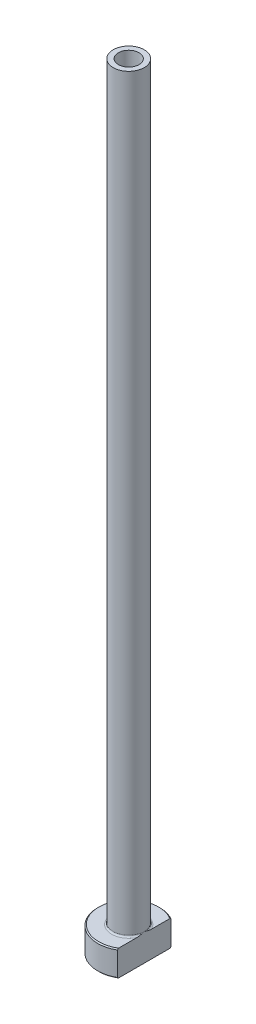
ISO-10303-21;
HEADER;
FILE_DESCRIPTION(('STEP AP214'),'2;1');
FILE_NAME('part.step','',(''),(''),'','','');
FILE_SCHEMA(('AUTOMOTIVE_DESIGN { 1 0 10303 214 1 1 1 1 }'));
ENDSEC;
DATA;
#1=APPLICATION_CONTEXT('core data for automotive mechanical design processes');
#2=APPLICATION_PROTOCOL_DEFINITION('international standard','automotive_design',2000,#1);
#3=PRODUCT_CONTEXT('',#1,'mechanical');
#4=PRODUCT('Part','Part','',(#3));
#5=PRODUCT_RELATED_PRODUCT_CATEGORY('part','',(#4));
#6=PRODUCT_DEFINITION_FORMATION('','',#4);
#7=PRODUCT_DEFINITION_CONTEXT('part definition',#1,'design');
#8=PRODUCT_DEFINITION('design','',#6,#7);
#9=PRODUCT_DEFINITION_SHAPE('','',#8);
#10=(LENGTH_UNIT() NAMED_UNIT(*) SI_UNIT(.MILLI.,.METRE.));
#11=(NAMED_UNIT(*) PLANE_ANGLE_UNIT() SI_UNIT($,.RADIAN.));
#12=(NAMED_UNIT(*) SI_UNIT($,.STERADIAN.) SOLID_ANGLE_UNIT());
#13=UNCERTAINTY_MEASURE_WITH_UNIT(LENGTH_MEASURE(1.E-05),#10,'distance_accuracy_value','');
#14=(GEOMETRIC_REPRESENTATION_CONTEXT(3) GLOBAL_UNCERTAINTY_ASSIGNED_CONTEXT((#13)) GLOBAL_UNIT_ASSIGNED_CONTEXT((#10,
#11,#12)) REPRESENTATION_CONTEXT('',''));
#15=CARTESIAN_POINT('',(0.,0.,0.));
#16=DIRECTION('',(0.,0.,1.));
#17=DIRECTION('',(1.,0.,0.));
#18=AXIS2_PLACEMENT_3D('',#15,#16,#17);
#19=CARTESIAN_POINT('',(0.,92.1876809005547,0.));
#20=DIRECTION('',(0.,1.,0.));
#21=DIRECTION('',(0.,0.,1.));
#22=AXIS2_PLACEMENT_3D('',#19,#20,#21);
#23=CYLINDRICAL_SURFACE('',#22,2.);
#24=CARTESIAN_POINT('',(0.,150.,0.));
#25=DIRECTION('',(0.,1.,0.));
#26=DIRECTION('',(0.,0.,1.));
#27=AXIS2_PLACEMENT_3D('',#24,#25,#26);
#28=CIRCLE('',#27,2.);
#29=CARTESIAN_POINT('',(0.,150.,2.));
#30=VERTEX_POINT('',#29);
#31=EDGE_CURVE('E167',#30,#30,#28,.T.);
#32=ORIENTED_EDGE('',*,*,#31,.T.);
#33=EDGE_LOOP('',(#32));
#34=FACE_BOUND('',#33,.T.);
#35=CARTESIAN_POINT('',(0.,105.,0.));
#36=DIRECTION('',(0.,1.,0.));
#37=DIRECTION('',(0.,0.,1.));
#38=AXIS2_PLACEMENT_3D('',#35,#36,#37);
#39=CIRCLE('',#38,2.);
#40=CARTESIAN_POINT('',(0.,105.,2.));
#41=VERTEX_POINT('',#40);
#42=EDGE_CURVE('E170',#41,#41,#39,.T.);
#43=ORIENTED_EDGE('',*,*,#42,.F.);
#44=EDGE_LOOP('',(#43));
#45=FACE_BOUND('',#44,.T.);
#46=ADVANCED_FACE('F32',(#34,#45),#23,.F.);
#47=CARTESIAN_POINT('',(-2.,150.,0.));
#48=DIRECTION('',(0.,1.,0.));
#49=DIRECTION('',(0.,0.,1.));
#50=AXIS2_PLACEMENT_3D('',#47,#48,#49);
#51=PLANE('',#50);
#52=CARTESIAN_POINT('',(0.,150.,0.));
#53=DIRECTION('',(0.,1.,0.));
#54=DIRECTION('',(0.,0.,1.));
#55=AXIS2_PLACEMENT_3D('',#52,#53,#54);
#56=CIRCLE('',#55,3.00000000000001);
#57=CARTESIAN_POINT('',(0.,150.,3.00000000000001));
#58=VERTEX_POINT('',#57);
#59=EDGE_CURVE('E174',#58,#58,#56,.T.);
#60=ORIENTED_EDGE('',*,*,#59,.T.);
#61=EDGE_LOOP('',(#60));
#62=FACE_BOUND('',#61,.T.);
#63=ORIENTED_EDGE('',*,*,#31,.F.);
#64=EDGE_LOOP('',(#63));
#65=FACE_BOUND('',#64,.T.);
#66=ADVANCED_FACE('F157',(#62,#65),#51,.T.);
#67=CARTESIAN_POINT('',(0.,92.1876809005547,0.));
#68=DIRECTION('',(0.,1.,0.));
#69=DIRECTION('',(0.,0.,1.));
#70=AXIS2_PLACEMENT_3D('',#67,#68,#69);
#71=CYLINDRICAL_SURFACE('',#70,3.);
#72=CARTESIAN_POINT('',(0.,5.3,0.));
#73=DIRECTION('',(0.,1.,0.));
#74=DIRECTION('',(0.,0.,1.));
#75=AXIS2_PLACEMENT_3D('',#72,#73,#74);
#76=CIRCLE('',#75,3.);
#77=CARTESIAN_POINT('',(3.,5.3,0.));
#78=VERTEX_POINT('',#77);
#79=EDGE_CURVE('E180',#78,#78,#76,.T.);
#80=ORIENTED_EDGE('',*,*,#79,.T.);
#81=EDGE_LOOP('',(#80));
#82=FACE_BOUND('',#81,.T.);
#83=ORIENTED_EDGE('',*,*,#59,.F.);
#84=EDGE_LOOP('',(#83));
#85=FACE_BOUND('',#84,.T.);
#86=ADVANCED_FACE('F162',(#82,#85),#71,.T.);
#87=CARTESIAN_POINT('',(-2.99999999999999,5.,0.));
#88=DIRECTION('',(0.,1.,0.));
#89=DIRECTION('',(0.,0.,1.));
#90=AXIS2_PLACEMENT_3D('',#87,#88,#89);
#91=PLANE('',#90);
#92=DIRECTION('',(0.,0.,1.));
#93=VECTOR('',#92,1.);
#94=CARTESIAN_POINT('',(2.99999999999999,5.,0.));
#95=LINE('',#94,#93);
#96=CARTESIAN_POINT('',(3.,5.,-4.96386945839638));
#97=VERTEX_POINT('',#96);
#98=CARTESIAN_POINT('',(2.99999999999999,5.,-1.37477270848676));
#99=VERTEX_POINT('',#98);
#100=EDGE_CURVE('E54',#97,#99,#95,.T.);
#101=ORIENTED_EDGE('',*,*,#100,.F.);
#102=CARTESIAN_POINT('',(0.,5.,0.));
#103=DIRECTION('',(0.,1.,0.));
#104=DIRECTION('',(0.,0.,1.));
#105=AXIS2_PLACEMENT_3D('',#102,#103,#104);
#106=CIRCLE('',#105,5.80000000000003);
#107=CARTESIAN_POINT('',(2.99999999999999,5.,4.96386945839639));
#108=VERTEX_POINT('',#107);
#109=EDGE_CURVE('E186',#97,#108,#106,.T.);
#110=ORIENTED_EDGE('',*,*,#109,.T.);
#111=CARTESIAN_POINT('',(2.99999999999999,5.,1.37477270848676));
#112=VERTEX_POINT('',#111);
#113=EDGE_CURVE('E134',#112,#108,#95,.T.);
#114=ORIENTED_EDGE('',*,*,#113,.F.);
#115=CARTESIAN_POINT('',(0.,5.,0.));
#116=DIRECTION('',(0.,1.,0.));
#117=DIRECTION('',(0.,0.,1.));
#118=AXIS2_PLACEMENT_3D('',#115,#116,#117);
#119=CIRCLE('',#118,3.3);
#120=EDGE_CURVE('E183',#112,#99,#119,.F.);
#121=ORIENTED_EDGE('',*,*,#120,.T.);
#122=EDGE_LOOP('',(#101,#110,#114,#121));
#123=FACE_BOUND('',#122,.T.);
#124=ADVANCED_FACE('F197',(#123),#91,.T.);
#125=CARTESIAN_POINT('',(0.,92.1876809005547,0.));
#126=DIRECTION('',(0.,1.,0.));
#127=DIRECTION('',(0.,0.,1.));
#128=AXIS2_PLACEMENT_3D('',#125,#126,#127);
#129=CYLINDRICAL_SURFACE('',#128,5.99999999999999);
#130=DIRECTION('',(0.,-1.,0.));
#131=VECTOR('',#130,1.);
#132=CARTESIAN_POINT('',(2.99999999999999,150.,5.19615242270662));
#133=LINE('',#132,#131);
#134=CARTESIAN_POINT('',(2.99999999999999,4.80000000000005,5.19615242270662));
#135=VERTEX_POINT('',#134);
#136=CARTESIAN_POINT('',(2.99999999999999,0.199999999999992,5.19615242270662));
#137=VERTEX_POINT('',#136);
#138=EDGE_CURVE('E82',#135,#137,#133,.T.);
#139=ORIENTED_EDGE('',*,*,#138,.F.);
#140=CARTESIAN_POINT('',(0.,4.80000000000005,0.));
#141=DIRECTION('',(0.,1.,0.));
#142=DIRECTION('',(0.,0.,1.));
#143=AXIS2_PLACEMENT_3D('',#140,#141,#142);
#144=CIRCLE('',#143,5.99999999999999);
#145=CARTESIAN_POINT('',(3.,4.80000000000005,-5.19615242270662));
#146=VERTEX_POINT('',#145);
#147=EDGE_CURVE('E95',#135,#146,#144,.F.);
#148=ORIENTED_EDGE('',*,*,#147,.T.);
#149=DIRECTION('',(0.,-1.,0.));
#150=VECTOR('',#149,1.);
#151=CARTESIAN_POINT('',(3.,150.,-5.19615242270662));
#152=LINE('',#151,#150);
#153=CARTESIAN_POINT('',(3.,0.199999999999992,-5.19615242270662));
#154=VERTEX_POINT('',#153);
#155=EDGE_CURVE('E192',#146,#154,#152,.T.);
#156=ORIENTED_EDGE('',*,*,#155,.T.);
#157=CARTESIAN_POINT('',(0.,0.199999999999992,0.));
#158=DIRECTION('',(0.,-1.,0.));
#159=DIRECTION('',(0.,0.,-1.));
#160=AXIS2_PLACEMENT_3D('',#157,#158,#159);
#161=CIRCLE('',#160,5.99999999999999);
#162=EDGE_CURVE('E98',#154,#137,#161,.F.);
#163=ORIENTED_EDGE('',*,*,#162,.T.);
#164=EDGE_LOOP('',(#139,#148,#156,#163));
#165=FACE_BOUND('',#164,.T.);
#166=ADVANCED_FACE('F190',(#165),#129,.T.);
#167=CARTESIAN_POINT('',(-5.99999999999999,0.,0.));
#168=DIRECTION('',(0.,-1.,0.));
#169=DIRECTION('',(0.,0.,-1.));
#170=AXIS2_PLACEMENT_3D('',#167,#168,#169);
#171=PLANE('',#170);
#172=CARTESIAN_POINT('',(0.,0.,0.));
#173=DIRECTION('',(0.,-1.,0.));
#174=DIRECTION('',(0.,0.,-1.));
#175=AXIS2_PLACEMENT_3D('',#172,#173,#174);
#176=CIRCLE('',#175,2.74999999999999);
#177=CARTESIAN_POINT('',(0.,0.,-2.74999999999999));
#178=VERTEX_POINT('',#177);
#179=EDGE_CURVE('E40',#178,#178,#176,.F.);
#180=ORIENTED_EDGE('',*,*,#179,.T.);
#181=EDGE_LOOP('',(#180));
#182=FACE_BOUND('',#181,.T.);
#183=DIRECTION('',(0.,0.,-1.));
#184=VECTOR('',#183,1.);
#185=CARTESIAN_POINT('',(2.99999999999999,0.,5.19615242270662));
#186=LINE('',#185,#184);
#187=CARTESIAN_POINT('',(2.99999999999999,0.,4.96386945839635));
#188=VERTEX_POINT('',#187);
#189=CARTESIAN_POINT('',(2.99999999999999,0.,-4.96386945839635));
#190=VERTEX_POINT('',#189);
#191=EDGE_CURVE('E47',#188,#190,#186,.T.);
#192=ORIENTED_EDGE('',*,*,#191,.F.);
#193=CARTESIAN_POINT('',(0.,0.,0.));
#194=DIRECTION('',(0.,-1.,0.));
#195=DIRECTION('',(0.,0.,-1.));
#196=AXIS2_PLACEMENT_3D('',#193,#194,#195);
#197=CIRCLE('',#196,5.8);
#198=EDGE_CURVE('E92',#188,#190,#197,.T.);
#199=ORIENTED_EDGE('',*,*,#198,.T.);
#200=EDGE_LOOP('',(#192,#199));
#201=FACE_BOUND('',#200,.T.);
#202=ADVANCED_FACE('F91',(#182,#201),#171,.T.);
#203=CARTESIAN_POINT('',(0.,92.1876809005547,0.));
#204=DIRECTION('',(0.,1.,0.));
#205=DIRECTION('',(0.,0.,1.));
#206=AXIS2_PLACEMENT_3D('',#203,#204,#205);
#207=CYLINDRICAL_SURFACE('',#206,2.25);
#208=CARTESIAN_POINT('',(0.,0.499999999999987,0.));
#209=DIRECTION('',(0.,-1.,0.));
#210=DIRECTION('',(0.,0.,-1.));
#211=AXIS2_PLACEMENT_3D('',#208,#209,#210);
#212=CIRCLE('',#211,2.25);
#213=CARTESIAN_POINT('',(0.,0.499999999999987,-2.25));
#214=VERTEX_POINT('',#213);
#215=EDGE_CURVE('E11',#214,#214,#212,.T.);
#216=ORIENTED_EDGE('',*,*,#215,.T.);
#217=EDGE_LOOP('',(#216));
#218=FACE_BOUND('',#217,.T.);
#219=CARTESIAN_POINT('',(0.,93.,0.));
#220=DIRECTION('',(0.,1.,0.));
#221=DIRECTION('',(0.,0.,1.));
#222=AXIS2_PLACEMENT_3D('',#219,#220,#221);
#223=CIRCLE('',#222,2.25);
#224=CARTESIAN_POINT('',(0.,93.,2.25));
#225=VERTEX_POINT('',#224);
#226=EDGE_CURVE('E172',#225,#225,#223,.T.);
#227=ORIENTED_EDGE('',*,*,#226,.T.);
#228=EDGE_LOOP('',(#227));
#229=FACE_BOUND('',#228,.T.);
#230=ADVANCED_FACE('F215',(#218,#229),#207,.F.);
#231=CARTESIAN_POINT('',(0.,93.,0.));
#232=DIRECTION('',(0.,-1.,0.));
#233=DIRECTION('',(0.,0.,-1.));
#234=AXIS2_PLACEMENT_3D('',#231,#232,#233);
#235=CONICAL_SURFACE('',#234,2.25,0.0208303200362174);
#236=ORIENTED_EDGE('',*,*,#42,.T.);
#237=EDGE_LOOP('',(#236));
#238=FACE_BOUND('',#237,.T.);
#239=ORIENTED_EDGE('',*,*,#226,.F.);
#240=EDGE_LOOP('',(#239));
#241=FACE_BOUND('',#240,.T.);
#242=ADVANCED_FACE('F111',(#238,#241),#235,.F.);
#243=CARTESIAN_POINT('',(0.,5.3,0.));
#244=DIRECTION('',(0.,1.,0.));
#245=DIRECTION('',(0.,0.,1.));
#246=AXIS2_PLACEMENT_3D('',#243,#244,#245);
#247=TOROIDAL_SURFACE('',#246,3.3,0.3);
#248=ORIENTED_EDGE('',*,*,#120,.F.);
#249=CARTESIAN_POINT('',(3.,5.3,0.));
#250=CARTESIAN_POINT('',(3.,5.30000062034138,-1.12617432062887E-10));
#251=CARTESIAN_POINT('',(3.,5.30000124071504,1.79706792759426E-07));
#252=CARTESIAN_POINT('',(3.,5.30000241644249,7.12597520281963E-07));
#253=CARTESIAN_POINT('',(3.,5.30000296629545,1.07470904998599E-06));
#254=CARTESIAN_POINT('',(3.,5.30000408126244,1.93940818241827E-06));
#255=CARTESIAN_POINT('',(3.,5.3000046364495,2.45488607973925E-06));
#256=CARTESIAN_POINT('',(3.,5.30000565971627,3.54465539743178E-06));
#257=CARTESIAN_POINT('',(3.,5.30000612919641,4.11770684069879E-06));
#258=CARTESIAN_POINT('',(3.,5.30000778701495,6.25396466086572E-06));
#259=CARTESIAN_POINT('',(3.,5.30000888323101,7.89070870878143E-06));
#260=CARTESIAN_POINT('',(3.,5.30001076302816,1.11998055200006E-05));
#261=CARTESIAN_POINT('',(3.,5.30001156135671,1.28642114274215E-05));
#262=CARTESIAN_POINT('',(3.,5.30001474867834,1.9653717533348E-05));
#263=CARTESIAN_POINT('',(3.,5.30001702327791,2.4838024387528E-05));
#264=CARTESIAN_POINT('',(3.,5.30002052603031,3.4817848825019E-05));
#265=CARTESIAN_POINT('',(3.,5.30002184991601,3.95800630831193E-05));
#266=CARTESIAN_POINT('',(3.,5.30003122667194,7.41814386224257E-05));
#267=CARTESIAN_POINT('',(3.,5.30003808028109,0.000104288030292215));
#268=CARTESIAN_POINT('',(3.,5.30006804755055,0.000222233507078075));
#269=CARTESIAN_POINT('',(3.,5.30009687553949,0.000308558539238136));
#270=CARTESIAN_POINT('',(2.99999999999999,5.30020809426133,0.000648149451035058));
#271=CARTESIAN_POINT('',(3.,5.30028657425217,0.000902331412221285));
#272=CARTESIAN_POINT('',(3.,5.30059876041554,0.00190491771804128));
#273=CARTESIAN_POINT('',(3.,5.30083723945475,0.00265218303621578));
#274=CARTESIAN_POINT('',(2.99999999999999,5.30182192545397,0.00574694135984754));
#275=CARTESIAN_POINT('',(3.,5.30256224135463,0.00809584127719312));
#276=CARTESIAN_POINT('',(3.,5.3116026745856,0.0367678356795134));
#277=CARTESIAN_POINT('',(3.,5.31993817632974,0.0630827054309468));
#278=CARTESIAN_POINT('',(2.99999999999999,5.33621504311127,0.114704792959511));
#279=CARTESIAN_POINT('',(3.,5.34415908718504,0.140011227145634));
#280=CARTESIAN_POINT('',(3.,5.36094382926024,0.193774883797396));
#281=CARTESIAN_POINT('',(3.,5.3697741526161,0.2222354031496));
#282=CARTESIAN_POINT('',(3.,5.38736474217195,0.279512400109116));
#283=CARTESIAN_POINT('',(3.,5.39612323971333,0.308329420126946));
#284=CARTESIAN_POINT('',(3.,5.41726575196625,0.378880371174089));
#285=CARTESIAN_POINT('',(3.,5.42952723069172,0.420651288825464));
#286=CARTESIAN_POINT('',(3.,5.45309597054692,0.50335758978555));
#287=CARTESIAN_POINT('',(3.,5.46441924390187,0.544288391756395));
#288=CARTESIAN_POINT('',(3.,5.48778169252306,0.632156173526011));
#289=CARTESIAN_POINT('',(3.,5.49969678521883,0.679126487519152));
#290=CARTESIAN_POINT('',(3.,5.52221484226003,0.773740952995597));
#291=CARTESIAN_POINT('',(3.,5.53280772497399,0.821387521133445));
#292=CARTESIAN_POINT('',(3.,5.55291503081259,0.920589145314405));
#293=CARTESIAN_POINT('',(3.,5.56229188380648,0.972172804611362));
#294=CARTESIAN_POINT('',(3.,5.57838694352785,1.07574836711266));
#295=CARTESIAN_POINT('',(3.,5.58510535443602,1.12774023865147));
#296=CARTESIAN_POINT('',(3.,5.59681427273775,1.24924411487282));
#297=CARTESIAN_POINT('',(3.,5.60051317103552,1.31890364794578));
#298=CARTESIAN_POINT('',(3.,5.59966579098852,1.42270835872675));
#299=CARTESIAN_POINT('',(3.,5.59835823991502,1.45688093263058));
#300=CARTESIAN_POINT('',(3.,5.59322745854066,1.5250253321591));
#301=CARTESIAN_POINT('',(3.,5.58940645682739,1.55899730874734));
#302=CARTESIAN_POINT('',(3.,5.57976146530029,1.61947815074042));
#303=CARTESIAN_POINT('',(3.,5.57451506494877,1.64607760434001));
#304=CARTESIAN_POINT('',(3.,5.56161153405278,1.69883648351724));
#305=CARTESIAN_POINT('',(3.,5.5539433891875,1.72499331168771));
#306=CARTESIAN_POINT('',(3.,5.53555176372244,1.7765091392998));
#307=CARTESIAN_POINT('',(3.,5.5248003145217,1.80185836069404));
#308=CARTESIAN_POINT('',(3.,5.49948027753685,1.85054545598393));
#309=CARTESIAN_POINT('',(3.,5.48493141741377,1.87389291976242));
#310=CARTESIAN_POINT('',(3.,5.45992470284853,1.90552135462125));
#311=CARTESIAN_POINT('',(3.,5.45133318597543,1.91527363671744));
#312=CARTESIAN_POINT('',(3.,5.43294163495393,1.93360072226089));
#313=CARTESIAN_POINT('',(3.,5.42314083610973,1.94217477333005));
#314=CARTESIAN_POINT('',(3.,5.40215892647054,1.95778354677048));
#315=CARTESIAN_POINT('',(3.,5.39096156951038,1.96479687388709));
#316=CARTESIAN_POINT('',(3.,5.36742144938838,1.97652218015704));
#317=CARTESIAN_POINT('',(3.,5.35508207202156,1.98124071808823));
#318=CARTESIAN_POINT('',(3.,5.33320117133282,1.98690185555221));
#319=CARTESIAN_POINT('',(3.,5.32383559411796,1.98852953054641));
#320=CARTESIAN_POINT('',(3.,5.30496375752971,1.99016898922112));
#321=CARTESIAN_POINT('',(3.,5.29545756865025,1.99018155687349));
#322=CARTESIAN_POINT('',(3.,5.2765931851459,1.98858978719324));
#323=CARTESIAN_POINT('',(3.,5.26723486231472,1.98698693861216));
#324=CARTESIAN_POINT('',(3.,5.24889957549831,1.98229727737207));
#325=CARTESIAN_POINT('',(3.,5.239922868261,1.97920948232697));
#326=CARTESIAN_POINT('',(3.,5.21981293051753,1.97059641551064));
#327=CARTESIAN_POINT('',(3.,5.20887713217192,1.9646117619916));
#328=CARTESIAN_POINT('',(3.,5.18811536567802,1.95095727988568));
#329=CARTESIAN_POINT('',(3.,5.17829177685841,1.94328393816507));
#330=CARTESIAN_POINT('',(3.,5.15512177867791,1.92254223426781));
#331=CARTESIAN_POINT('',(3.,5.14247568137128,1.90869680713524));
#332=CARTESIAN_POINT('',(3.,5.11944595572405,1.8792758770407));
#333=CARTESIAN_POINT('',(3.,5.10906527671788,1.86369815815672));
#334=CARTESIAN_POINT('',(3.,5.08309609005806,1.81927355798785));
#335=CARTESIAN_POINT('',(3.,5.06948546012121,1.7892808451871));
#336=CARTESIAN_POINT('',(3.,5.04658664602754,1.72751962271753));
#337=CARTESIAN_POINT('',(3.,5.03733582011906,1.69573828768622));
#338=CARTESIAN_POINT('',(3.,5.02214318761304,1.63079918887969));
#339=CARTESIAN_POINT('',(3.,5.01626537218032,1.5976268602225));
#340=CARTESIAN_POINT('',(3.,5.00734002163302,1.53086029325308));
#341=CARTESIAN_POINT('',(3.,5.00429797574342,1.49726536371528));
#342=CARTESIAN_POINT('',(3.,5.00059037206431,1.43100872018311));
#343=CARTESIAN_POINT('',(3.,4.99985343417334,1.39835069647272));
#344=CARTESIAN_POINT('',(3.,5.00019322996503,1.33318312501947));
#345=CARTESIAN_POINT('',(3.,5.00126261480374,1.30067351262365));
#346=CARTESIAN_POINT('',(3.,5.00569854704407,1.22190465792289));
#347=CARTESIAN_POINT('',(3.,5.00984986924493,1.17569031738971));
#348=CARTESIAN_POINT('',(3.,5.02060876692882,1.08357061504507));
#349=CARTESIAN_POINT('',(3.,5.02721586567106,1.03766519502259));
#350=CARTESIAN_POINT('',(3.,5.04258096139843,0.94513016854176));
#351=CARTESIAN_POINT('',(3.,5.05138514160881,0.898508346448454));
#352=CARTESIAN_POINT('',(3.,5.07066869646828,0.805496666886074));
#353=CARTESIAN_POINT('',(3.,5.08115218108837,0.75910767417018));
#354=CARTESIAN_POINT('',(3.,5.10738921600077,0.650207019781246));
#355=CARTESIAN_POINT('',(3.,5.12369110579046,0.587828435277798));
#356=CARTESIAN_POINT('',(3.,5.15777680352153,0.464212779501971));
#357=CARTESIAN_POINT('',(3.,5.17554263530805,0.402970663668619));
#358=CARTESIAN_POINT('',(3.,5.21006724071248,0.287596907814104));
#359=CARTESIAN_POINT('',(3.,5.22671796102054,0.233432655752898));
#360=CARTESIAN_POINT('',(3.,5.2524122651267,0.1509408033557));
#361=CARTESIAN_POINT('',(2.99999999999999,5.26131063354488,0.122567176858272));
#362=CARTESIAN_POINT('',(3.,5.27905176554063,0.0662804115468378));
#363=CARTESIAN_POINT('',(3.,5.28789327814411,0.0383669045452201));
#364=CARTESIAN_POINT('',(3.,5.29743877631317,0.00809257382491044));
#365=CARTESIAN_POINT('',(2.99999999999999,5.29818012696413,0.00574041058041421));
#366=CARTESIAN_POINT('',(3.,5.29916506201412,0.00264489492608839));
#367=CARTESIAN_POINT('',(3.,5.2994027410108,0.00190013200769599));
#368=CARTESIAN_POINT('',(3.,5.29971394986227,0.000900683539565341));
#369=CARTESIAN_POINT('',(2.99999999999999,5.29979223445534,0.000647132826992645));
#370=CARTESIAN_POINT('',(3.,5.29990321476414,0.000308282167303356));
#371=CARTESIAN_POINT('',(3.,5.29993200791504,0.000222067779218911));
#372=CARTESIAN_POINT('',(3.,5.29996194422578,0.000104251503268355));
#373=CARTESIAN_POINT('',(3.,5.29996879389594,7.41614227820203E-05));
#374=CARTESIAN_POINT('',(3.,5.29997816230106,3.95766697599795E-05));
#375=CARTESIAN_POINT('',(3.,5.29997948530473,3.48154656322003E-05));
#376=CARTESIAN_POINT('',(3.,5.29998298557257,2.48376271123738E-05));
#377=CARTESIAN_POINT('',(3.,5.29998525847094,1.96542446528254E-05));
#378=CARTESIAN_POINT('',(3.,5.29998844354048,1.28656650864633E-05));
#379=CARTESIAN_POINT('',(3.,5.29998924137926,1.12013345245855E-05));
#380=CARTESIAN_POINT('',(3.,5.29999112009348,7.89229990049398E-06));
#381=CARTESIAN_POINT('',(3.,5.29999221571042,6.25553503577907E-06));
#382=CARTESIAN_POINT('',(3.,5.29999387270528,4.11914349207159E-06));
#383=CARTESIAN_POINT('',(3.,5.29999434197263,3.546030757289E-06));
#384=CARTESIAN_POINT('',(3.,5.29999536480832,2.45610052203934E-06));
#385=CARTESIAN_POINT('',(3.,5.29999591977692,1.94052214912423E-06));
#386=CARTESIAN_POINT('',(3.,5.29999703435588,1.07558314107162E-06));
#387=CARTESIAN_POINT('',(3.,5.29999758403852,7.1333937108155E-07));
#388=CARTESIAN_POINT('',(3.,5.29999875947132,1.80121911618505E-07));
#389=CARTESIAN_POINT('',(3.,5.29999937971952,1.12606876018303E-10));
#390=CARTESIAN_POINT('',(3.,5.3,0.));
#391=B_SPLINE_CURVE_WITH_KNOTS('',3,(#249,#250,#251,#252,#253,#254,#255,#256,#257,#258,#259,
#260,#261,#262,#263,#264,#265,#266,#267,#268,#269,#270,#271,#272,#273,#274,#275,#276,#277,#278,
#279,#280,#281,#282,#283,#284,#285,#286,#287,#288,#289,#290,#291,#292,#293,#294,#295,#296,#297,
#298,#299,#300,#301,#302,#303,#304,#305,#306,#307,#308,#309,#310,#311,#312,#313,#314,#315,#316,
#317,#318,#319,#320,#321,#322,#323,#324,#325,#326,#327,#328,#329,#330,#331,#332,#333,#334,#335,
#336,#337,#338,#339,#340,#341,#342,#343,#344,#345,#346,#347,#348,#349,#350,#351,#352,#353,#354,
#355,#356,#357,#358,#359,#360,#361,#362,#363,#364,#365,#366,#367,#368,#369,#370,#371,#372,#373,
#374,#375,#376,#377,#378,#379,#380,#381,#382,#383,#384,#385,#386,#387,#388,#389,#390),
.UNSPECIFIED.,.T.,.F.,(4,2,2,2,2,2,2,2,2,2,2,2,2,2,2,2,2,2,2,2,2,2,2,2,2,2,2,2,2,2,2,2,2,2,2,2,
2,2,2,2,2,2,2,2,2,2,2,2,2,2,2,2,2,2,2,2,2,2,2,2,2,2,2,2,2,2,2,2,2,2,4),(0.,1.86513895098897E-06,
3.83353302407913E-06,6.0951331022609E-06,8.31560634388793E-06,1.42000709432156E-05,
1.97335511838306E-05,3.66769875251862E-05,5.1485833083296E-05,0.000144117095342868,
0.000416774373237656,0.00121521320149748,0.00356794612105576,0.0109568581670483,
0.0937636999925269,0.173336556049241,0.262732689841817,0.353088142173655,0.483684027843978,
0.611082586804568,0.75643954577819,0.902844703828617,1.06007042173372,1.21728406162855,
1.42611662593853,1.52864191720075,1.63107642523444,1.71232857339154,1.79395571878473,
1.87634808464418,1.95832065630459,1.9972276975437,2.0361594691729,2.07559591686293,
2.1149189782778,2.1433091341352,2.17168550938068,2.20003575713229,2.22840478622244,
2.26559554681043,2.30286442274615,2.35880214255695,2.41481225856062,2.51307007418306,
2.61215518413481,2.71306273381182,2.81416520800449,2.91210427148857,3.00964583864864,
3.14875779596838,3.2878427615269,3.4301423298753,3.57279564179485,3.76617940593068,
3.95746724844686,4.12746077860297,4.21667041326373,4.30450746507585,4.31190664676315,
4.31425150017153,4.3150479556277,4.3153202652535,4.31541284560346,4.31542765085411,
4.3154445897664,4.3154501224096,4.31545600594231,4.31545822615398,4.31546048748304,
4.31546245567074,4.31546432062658),.UNSPECIFIED.);
#392=EDGE_CURVE('E126',#112,#78,#391,.T.);
#393=ORIENTED_EDGE('',*,*,#392,.T.);
#394=ORIENTED_EDGE('',*,*,#79,.F.);
#395=CARTESIAN_POINT('',(3.,5.3,0.));
#396=CARTESIAN_POINT('',(3.,5.29999937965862,1.12617728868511E-10));
#397=CARTESIAN_POINT('',(3.,5.29999875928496,-1.79706792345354E-07));
#398=CARTESIAN_POINT('',(3.,5.2999975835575,-7.12597519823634E-07));
#399=CARTESIAN_POINT('',(3.,5.29999703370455,-1.07470904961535E-06));
#400=CARTESIAN_POINT('',(3.,5.29999591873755,-1.93940818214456E-06));
#401=CARTESIAN_POINT('',(3.,5.2999953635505,-2.45488607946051E-06));
#402=CARTESIAN_POINT('',(3.,5.29999434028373,-3.54465539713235E-06));
#403=CARTESIAN_POINT('',(3.,5.29999387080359,-4.1177068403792E-06));
#404=CARTESIAN_POINT('',(3.,5.29999221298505,-6.2539646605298E-06));
#405=CARTESIAN_POINT('',(3.,5.29999111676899,-7.8907087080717E-06));
#406=CARTESIAN_POINT('',(3.,5.29998923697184,-1.11998055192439E-05));
#407=CARTESIAN_POINT('',(3.,5.29998843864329,-1.28642114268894E-05));
#408=CARTESIAN_POINT('',(3.,5.29998525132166,-1.96537175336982E-05));
#409=CARTESIAN_POINT('',(3.,5.29998297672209,-2.4838024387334E-05));
#410=CARTESIAN_POINT('',(3.,5.29997947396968,-3.48178488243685E-05));
#411=CARTESIAN_POINT('',(3.,5.29997815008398,-3.95800630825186E-05));
#412=CARTESIAN_POINT('',(3.,5.29996877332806,-7.41814386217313E-05));
#413=CARTESIAN_POINT('',(3.,5.29996191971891,-0.000104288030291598));
#414=CARTESIAN_POINT('',(3.,5.29993195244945,-0.000222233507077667));
#415=CARTESIAN_POINT('',(3.,5.29990312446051,-0.000308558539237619));
#416=CARTESIAN_POINT('',(2.99999999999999,5.29979190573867,-0.000648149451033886));
#417=CARTESIAN_POINT('',(3.,5.29971342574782,-0.000902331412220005));
#418=CARTESIAN_POINT('',(3.,5.29940123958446,-0.0019049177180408));
#419=CARTESIAN_POINT('',(3.,5.29916276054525,-0.00265218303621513));
#420=CARTESIAN_POINT('',(2.99999999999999,5.29817807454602,-0.00574694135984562));
#421=CARTESIAN_POINT('',(3.,5.29743775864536,-0.00809584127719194));
#422=CARTESIAN_POINT('',(3.,5.28839732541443,-0.0367678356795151));
#423=CARTESIAN_POINT('',(3.,5.28006182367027,-0.0630827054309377));
#424=CARTESIAN_POINT('',(2.99999999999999,5.26378495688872,-0.114704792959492));
#425=CARTESIAN_POINT('',(3.,5.25584091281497,-0.140011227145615));
#426=CARTESIAN_POINT('',(3.,5.23905617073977,-0.19377488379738));
#427=CARTESIAN_POINT('',(3.,5.23022584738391,-0.222235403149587));
#428=CARTESIAN_POINT('',(3.,5.21263525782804,-0.279512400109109));
#429=CARTESIAN_POINT('',(3.,5.20387676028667,-0.308329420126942));
#430=CARTESIAN_POINT('',(3.,5.18273424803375,-0.378880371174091));
#431=CARTESIAN_POINT('',(3.,5.17047276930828,-0.420651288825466));
#432=CARTESIAN_POINT('',(3.,5.14690402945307,-0.503357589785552));
#433=CARTESIAN_POINT('',(3.,5.13558075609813,-0.544288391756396));
#434=CARTESIAN_POINT('',(3.,5.11221830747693,-0.63215617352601));
#435=CARTESIAN_POINT('',(3.,5.10030321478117,-0.67912648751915));
#436=CARTESIAN_POINT('',(3.,5.07778515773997,-0.773740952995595));
#437=CARTESIAN_POINT('',(3.,5.06719227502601,-0.821387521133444));
#438=CARTESIAN_POINT('',(3.,5.04708496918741,-0.920589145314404));
#439=CARTESIAN_POINT('',(3.,5.03770811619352,-0.972172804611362));
#440=CARTESIAN_POINT('',(3.,5.02161305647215,-1.07574836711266));
#441=CARTESIAN_POINT('',(3.,5.01489464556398,-1.12774023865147));
#442=CARTESIAN_POINT('',(3.,5.00318572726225,-1.24924411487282));
#443=CARTESIAN_POINT('',(3.,4.99948682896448,-1.31890364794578));
#444=CARTESIAN_POINT('',(3.,5.00033420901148,-1.42270835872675));
#445=CARTESIAN_POINT('',(3.,5.00164176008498,-1.45688093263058));
#446=CARTESIAN_POINT('',(3.,5.00677254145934,-1.5250253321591));
#447=CARTESIAN_POINT('',(3.,5.01059354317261,-1.55899730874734));
#448=CARTESIAN_POINT('',(3.,5.02023853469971,-1.61947815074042));
#449=CARTESIAN_POINT('',(3.,5.02548493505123,-1.64607760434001));
#450=CARTESIAN_POINT('',(3.,5.03838846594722,-1.69883648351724));
#451=CARTESIAN_POINT('',(3.,5.04605661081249,-1.72499331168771));
#452=CARTESIAN_POINT('',(3.,5.06444823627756,-1.7765091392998));
#453=CARTESIAN_POINT('',(3.,5.07519968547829,-1.80185836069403));
#454=CARTESIAN_POINT('',(3.,5.10051972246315,-1.85054545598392));
#455=CARTESIAN_POINT('',(3.,5.11506858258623,-1.87389291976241));
#456=CARTESIAN_POINT('',(3.,5.14007529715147,-1.90552135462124));
#457=CARTESIAN_POINT('',(3.,5.14866681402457,-1.91527363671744));
#458=CARTESIAN_POINT('',(3.,5.16705836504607,-1.93360072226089));
#459=CARTESIAN_POINT('',(3.,5.17685916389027,-1.94217477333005));
#460=CARTESIAN_POINT('',(3.,5.19784107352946,-1.95778354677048));
#461=CARTESIAN_POINT('',(3.,5.20903843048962,-1.96479687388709));
#462=CARTESIAN_POINT('',(3.,5.23257855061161,-1.97652218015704));
#463=CARTESIAN_POINT('',(3.,5.24491792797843,-1.98124071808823));
#464=CARTESIAN_POINT('',(3.,5.26679882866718,-1.98690185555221));
#465=CARTESIAN_POINT('',(3.,5.27616440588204,-1.98852953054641));
#466=CARTESIAN_POINT('',(3.,5.29503624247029,-1.99016898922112));
#467=CARTESIAN_POINT('',(3.,5.30454243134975,-1.99018155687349));
#468=CARTESIAN_POINT('',(3.,5.32340681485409,-1.98858978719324));
#469=CARTESIAN_POINT('',(3.,5.33276513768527,-1.98698693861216));
#470=CARTESIAN_POINT('',(3.,5.35110042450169,-1.98229727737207));
#471=CARTESIAN_POINT('',(3.,5.360077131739,-1.97920948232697));
#472=CARTESIAN_POINT('',(3.,5.38018706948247,-1.97059641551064));
#473=CARTESIAN_POINT('',(3.,5.39112286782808,-1.9646117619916));
#474=CARTESIAN_POINT('',(3.,5.41188463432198,-1.95095727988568));
#475=CARTESIAN_POINT('',(3.,5.42170822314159,-1.94328393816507));
#476=CARTESIAN_POINT('',(3.,5.44487822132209,-1.92254223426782));
#477=CARTESIAN_POINT('',(3.,5.45752431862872,-1.90869680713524));
#478=CARTESIAN_POINT('',(3.,5.48055404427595,-1.87927587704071));
#479=CARTESIAN_POINT('',(3.,5.49093472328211,-1.86369815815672));
#480=CARTESIAN_POINT('',(3.,5.51690390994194,-1.81927355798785));
#481=CARTESIAN_POINT('',(3.,5.53051453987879,-1.7892808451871));
#482=CARTESIAN_POINT('',(3.,5.55341335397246,-1.72751962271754));
#483=CARTESIAN_POINT('',(3.,5.56266417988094,-1.69573828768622));
#484=CARTESIAN_POINT('',(3.,5.57785681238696,-1.6307991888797));
#485=CARTESIAN_POINT('',(3.,5.58373462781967,-1.59762686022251));
#486=CARTESIAN_POINT('',(3.,5.59265997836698,-1.53086029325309));
#487=CARTESIAN_POINT('',(3.,5.59570202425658,-1.49726536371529));
#488=CARTESIAN_POINT('',(3.,5.59940962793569,-1.43100872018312));
#489=CARTESIAN_POINT('',(3.,5.60014656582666,-1.39835069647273));
#490=CARTESIAN_POINT('',(3.,5.59980677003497,-1.33318312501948));
#491=CARTESIAN_POINT('',(3.,5.59873738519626,-1.30067351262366));
#492=CARTESIAN_POINT('',(3.,5.59430145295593,-1.2219046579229));
#493=CARTESIAN_POINT('',(3.,5.59015013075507,-1.17569031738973));
#494=CARTESIAN_POINT('',(3.,5.57939123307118,-1.08357061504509));
#495=CARTESIAN_POINT('',(3.,5.57278413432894,-1.03766519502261));
#496=CARTESIAN_POINT('',(3.,5.55741903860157,-0.94513016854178));
#497=CARTESIAN_POINT('',(3.,5.54861485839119,-0.898508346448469));
#498=CARTESIAN_POINT('',(3.,5.52933130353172,-0.805496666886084));
#499=CARTESIAN_POINT('',(3.,5.51884781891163,-0.759107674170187));
#500=CARTESIAN_POINT('',(3.,5.49261078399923,-0.650207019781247));
#501=CARTESIAN_POINT('',(3.,5.47630889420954,-0.587828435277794));
#502=CARTESIAN_POINT('',(3.,5.44222319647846,-0.464212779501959));
#503=CARTESIAN_POINT('',(3.,5.42445736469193,-0.402970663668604));
#504=CARTESIAN_POINT('',(3.,5.38993275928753,-0.28759690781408));
#505=CARTESIAN_POINT('',(3.,5.3732820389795,-0.23343265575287));
#506=CARTESIAN_POINT('',(3.,5.34758773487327,-0.150940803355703));
#507=CARTESIAN_POINT('',(2.99999999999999,5.33868936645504,-0.122567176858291));
#508=CARTESIAN_POINT('',(3.,5.32094823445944,-0.0662804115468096));
#509=CARTESIAN_POINT('',(3.,5.31210672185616,-0.0383669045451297));
#510=CARTESIAN_POINT('',(3.,5.30256122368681,-0.00809257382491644));
#511=CARTESIAN_POINT('',(2.99999999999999,5.30181987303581,-0.00574041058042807));
#512=CARTESIAN_POINT('',(3.,5.30083493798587,-0.00264489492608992));
#513=CARTESIAN_POINT('',(3.,5.3005972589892,-0.00190013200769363));
#514=CARTESIAN_POINT('',(3.,5.30028605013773,-0.000900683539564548));
#515=CARTESIAN_POINT('',(2.99999999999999,5.30020776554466,-0.000647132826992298));
#516=CARTESIAN_POINT('',(3.,5.30009678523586,-0.000308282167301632));
#517=CARTESIAN_POINT('',(3.,5.30006799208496,-0.000222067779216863));
#518=CARTESIAN_POINT('',(3.,5.30003805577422,-0.000104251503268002));
#519=CARTESIAN_POINT('',(3.,5.30003120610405,-7.41614227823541E-05));
#520=CARTESIAN_POINT('',(3.,5.30002183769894,-3.95766697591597E-05));
#521=CARTESIAN_POINT('',(3.,5.30002051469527,-3.48154656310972E-05));
#522=CARTESIAN_POINT('',(3.,5.30001701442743,-2.48376271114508E-05));
#523=CARTESIAN_POINT('',(3.,5.30001474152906,-1.96542446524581E-05));
#524=CARTESIAN_POINT('',(3.,5.30001155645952,-1.28656650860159E-05));
#525=CARTESIAN_POINT('',(3.,5.30001075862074,-1.12013345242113E-05));
#526=CARTESIAN_POINT('',(3.,5.30000887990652,-7.89229990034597E-06));
#527=CARTESIAN_POINT('',(3.,5.30000778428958,-6.25553503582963E-06));
#528=CARTESIAN_POINT('',(3.,5.30000612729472,-4.11914349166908E-06));
#529=CARTESIAN_POINT('',(3.,5.30000565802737,-3.54603075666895E-06));
#530=CARTESIAN_POINT('',(3.,5.30000463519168,-2.45610052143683E-06));
#531=CARTESIAN_POINT('',(3.,5.30000408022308,-1.94052214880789E-06));
#532=CARTESIAN_POINT('',(3.,5.30000296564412,-1.07558314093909E-06));
#533=CARTESIAN_POINT('',(3.,5.30000241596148,-7.13339370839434E-07));
#534=CARTESIAN_POINT('',(3.,5.30000124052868,-1.80121910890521E-07));
#535=CARTESIAN_POINT('',(3.,5.30000062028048,-1.12606171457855E-10));
#536=CARTESIAN_POINT('',(3.,5.3,0.));
#537=B_SPLINE_CURVE_WITH_KNOTS('',3,(#395,#396,#397,#398,#399,#400,#401,#402,#403,#404,#405,
#406,#407,#408,#409,#410,#411,#412,#413,#414,#415,#416,#417,#418,#419,#420,#421,#422,#423,#424,
#425,#426,#427,#428,#429,#430,#431,#432,#433,#434,#435,#436,#437,#438,#439,#440,#441,#442,#443,
#444,#445,#446,#447,#448,#449,#450,#451,#452,#453,#454,#455,#456,#457,#458,#459,#460,#461,#462,
#463,#464,#465,#466,#467,#468,#469,#470,#471,#472,#473,#474,#475,#476,#477,#478,#479,#480,#481,
#482,#483,#484,#485,#486,#487,#488,#489,#490,#491,#492,#493,#494,#495,#496,#497,#498,#499,#500,
#501,#502,#503,#504,#505,#506,#507,#508,#509,#510,#511,#512,#513,#514,#515,#516,#517,#518,#519,
#520,#521,#522,#523,#524,#525,#526,#527,#528,#529,#530,#531,#532,#533,#534,#535,#536),
.UNSPECIFIED.,.T.,.F.,(4,2,2,2,2,2,2,2,2,2,2,2,2,2,2,2,2,2,2,2,2,2,2,2,2,2,2,2,2,2,2,2,2,2,2,2,
2,2,2,2,2,2,2,2,2,2,2,2,2,2,2,2,2,2,2,2,2,2,2,2,2,2,2,2,2,2,2,2,2,2,4),(0.,1.86513895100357E-06,
3.8335330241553E-06,6.09513310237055E-06,8.31560634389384E-06,1.42000709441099E-05,
1.97335511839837E-05,3.66769875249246E-05,5.14858330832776E-05,0.000144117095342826,
0.000416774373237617,0.001215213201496,0.00356794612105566,0.0109568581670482,
0.0937636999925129,0.17333655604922,0.262732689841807,0.353088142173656,0.483684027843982,
0.611082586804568,0.756439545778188,0.902844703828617,1.06007042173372,1.21728406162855,
1.42611662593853,1.52864191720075,1.63107642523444,1.71232857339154,1.79395571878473,
1.87634808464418,1.95832065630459,1.9972276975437,2.03615946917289,2.07559591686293,
2.1149189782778,2.1433091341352,2.17168550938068,2.20003575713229,2.22840478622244,
2.26559554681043,2.30286442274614,2.35880214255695,2.41481225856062,2.51307007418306,
2.61215518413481,2.71306273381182,2.81416520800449,2.91210427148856,3.00964583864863,
3.14875779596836,3.28784276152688,3.43014232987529,3.57279564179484,3.76617940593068,
3.95746724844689,4.12746077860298,4.21667041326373,4.30450746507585,4.31190664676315,
4.31425150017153,4.3150479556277,4.3153202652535,4.31541284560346,4.31542765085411,
4.31544458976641,4.3154501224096,4.31545600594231,4.31545822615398,4.31546048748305,
4.31546245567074,4.31546432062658),.UNSPECIFIED.);
#538=EDGE_CURVE('E135',#78,#99,#537,.T.);
#539=ORIENTED_EDGE('',*,*,#538,.T.);
#540=EDGE_LOOP('',(#248,#393,#394,#539));
#541=FACE_BOUND('',#540,.T.);
#542=ADVANCED_FACE('F141',(#541),#247,.F.);
#543=CARTESIAN_POINT('',(0.,5.,0.));
#544=DIRECTION('',(0.,-1.,0.));
#545=DIRECTION('',(0.,0.,-1.));
#546=AXIS2_PLACEMENT_3D('',#543,#544,#545);
#547=CONICAL_SURFACE('',#546,5.80000000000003,0.785398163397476);
#548=CARTESIAN_POINT('',(3.,-1.0199395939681,-11.432889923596));
#549=CARTESIAN_POINT('',(3.,-0.769424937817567,-11.1738796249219));
#550=CARTESIAN_POINT('',(3.,-0.519179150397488,-10.9146084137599));
#551=CARTESIAN_POINT('',(3.,-0.0193842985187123,-10.3953890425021));
#552=CARTESIAN_POINT('',(3.,0.230164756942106,-10.1354408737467));
#553=CARTESIAN_POINT('',(3.,0.728528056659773,-9.6145860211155));
#554=CARTESIAN_POINT('',(3.,0.977341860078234,-9.35367891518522));
#555=CARTESIAN_POINT('',(3.,1.47386965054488,-8.83082274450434));
#556=CARTESIAN_POINT('',(3.,1.72158364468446,-8.56887368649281));
#557=CARTESIAN_POINT('',(3.,2.21069282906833,-8.0488414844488));
#558=CARTESIAN_POINT('',(3.,2.45211594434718,-7.79078462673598));
#559=CARTESIAN_POINT('',(3.,2.93315589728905,-7.27299342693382));
#560=CARTESIAN_POINT('',(3.,3.17277274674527,-7.01325909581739));
#561=CARTESIAN_POINT('',(3.,3.6495002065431,-6.49159990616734));
#562=CARTESIAN_POINT('',(3.,3.88661134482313,-6.22967553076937));
#563=CARTESIAN_POINT('',(3.,4.35738571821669,-5.70275148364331));
#564=CARTESIAN_POINT('',(3.,4.59104909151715,-5.43775193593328));
#565=CARTESIAN_POINT('',(3.,4.96416348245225,-5.00636825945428));
#566=CARTESIAN_POINT('',(3.,5.1052013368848,-4.84135845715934));
#567=CARTESIAN_POINT('',(3.,5.38476673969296,-4.50919282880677));
#568=CARTESIAN_POINT('',(3.,5.52329404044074,-4.34203679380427));
#569=CARTESIAN_POINT('',(3.,5.79842961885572,-4.00319933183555));
#570=CARTESIAN_POINT('',(3.,5.93500216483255,-3.83148875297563));
#571=CARTESIAN_POINT('',(3.,6.20336281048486,-3.48442112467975));
#572=CARTESIAN_POINT('',(3.,6.3351520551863,-3.30906496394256));
#573=CARTESIAN_POINT('',(3.,6.59393382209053,-2.95070802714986));
#574=CARTESIAN_POINT('',(3.,6.72082315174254,-2.76763161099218));
#575=CARTESIAN_POINT('',(3.,6.90336321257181,-2.48771743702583));
#576=CARTESIAN_POINT('',(3.,6.96295431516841,-2.39345390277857));
#577=CARTESIAN_POINT('',(3.,7.07882720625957,-2.20292146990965));
#578=CARTESIAN_POINT('',(3.,7.13510937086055,-2.10665280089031));
#579=CARTESIAN_POINT('',(3.,7.24288059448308,-1.91297779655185));
#580=CARTESIAN_POINT('',(3.,7.29441986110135,-1.81559978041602));
#581=CARTESIAN_POINT('',(3.,7.39241237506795,-1.61833215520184));
#582=CARTESIAN_POINT('',(3.,7.43886469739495,-1.51844209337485));
#583=CARTESIAN_POINT('',(3.,7.56840030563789,-1.21511948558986));
#584=CARTESIAN_POINT('',(3.,7.642090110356,-1.00730397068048));
#585=CARTESIAN_POINT('',(3.,7.72186700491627,-0.695731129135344));
#586=CARTESIAN_POINT('',(3.,7.74302901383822,-0.595791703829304));
#587=CARTESIAN_POINT('',(3.,7.77582528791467,-0.394325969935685));
#588=CARTESIAN_POINT('',(3.,7.78746040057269,-0.292799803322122));
#589=CARTESIAN_POINT('',(3.,7.80037895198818,-0.0893987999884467));
#590=CARTESIAN_POINT('',(3.,7.80169449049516,0.0124739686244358));
#591=CARTESIAN_POINT('',(3.,7.79396363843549,0.215826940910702));
#592=CARTESIAN_POINT('',(3.,7.78491639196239,0.317307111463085));
#593=CARTESIAN_POINT('',(3.,7.75721241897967,0.518039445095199));
#594=CARTESIAN_POINT('',(3.,7.73863812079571,0.617303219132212));
#595=CARTESIAN_POINT('',(3.,7.69303955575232,0.813850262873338));
#596=CARTESIAN_POINT('',(3.,7.6660142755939,0.91113329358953));
#597=CARTESIAN_POINT('',(3.,7.60464499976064,1.1039484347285));
#598=CARTESIAN_POINT('',(3.,7.57025976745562,1.19946724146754));
#599=CARTESIAN_POINT('',(3.,7.49555762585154,1.38810736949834));
#600=CARTESIAN_POINT('',(3.,7.45524192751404,1.48122917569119));
#601=CARTESIAN_POINT('',(3.,7.36961028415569,1.66561491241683));
#602=CARTESIAN_POINT('',(3.,7.32427350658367,1.7568690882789));
#603=CARTESIAN_POINT('',(3.,7.22966073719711,1.9373213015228));
#604=CARTESIAN_POINT('',(3.,7.18038388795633,2.02651888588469));
#605=CARTESIAN_POINT('',(3.,7.02771106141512,2.29153460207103));
#606=CARTESIAN_POINT('',(2.99999999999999,6.91955486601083,2.46460625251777));
#607=CARTESIAN_POINT('',(2.99999999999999,6.69440299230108,2.80577028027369));
#608=CARTESIAN_POINT('',(2.99999999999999,6.57737415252,2.9738403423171));
#609=CARTESIAN_POINT('',(2.99999999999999,6.33748949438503,3.30561771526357));
#610=CARTESIAN_POINT('',(2.99999999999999,6.21463662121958,3.46932716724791));
#611=CARTESIAN_POINT('',(2.99999999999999,5.9630808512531,3.79561670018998));
#612=CARTESIAN_POINT('',(2.99999999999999,5.83432224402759,3.95815356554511));
#613=CARTESIAN_POINT('',(2.99999999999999,5.57361365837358,4.28066737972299));
#614=CARTESIAN_POINT('',(2.99999999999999,5.44166333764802,4.44064405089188));
#615=CARTESIAN_POINT('',(2.99999999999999,5.17568445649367,4.7581955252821));
#616=CARTESIAN_POINT('',(2.99999999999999,5.04166171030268,4.91577521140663));
#617=CARTESIAN_POINT('',(2.99999999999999,4.77176230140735,5.22934053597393));
#618=CARTESIAN_POINT('',(2.99999999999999,4.63588560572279,5.38532614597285));
#619=CARTESIAN_POINT('',(2.99999999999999,4.27256222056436,5.79849838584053));
#620=CARTESIAN_POINT('',(2.99999999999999,4.04384014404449,6.05456265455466));
#621=CARTESIAN_POINT('',(2.99999999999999,3.58360020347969,6.5641703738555));
#622=CARTESIAN_POINT('',(2.99999999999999,3.35208226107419,6.81771375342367));
#623=CARTESIAN_POINT('',(2.99999999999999,2.88678846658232,7.32315936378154));
#624=CARTESIAN_POINT('',(2.99999999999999,2.65301069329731,7.57505982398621));
#625=CARTESIAN_POINT('',(2.99999999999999,2.18392232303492,8.07742926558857));
#626=CARTESIAN_POINT('',(2.99999999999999,1.94861172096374,8.32789824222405));
#627=CARTESIAN_POINT('',(2.99999999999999,1.48651581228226,8.81743943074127));
#628=CARTESIAN_POINT('',(2.99999999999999,1.25977806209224,9.05655656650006));
#629=CARTESIAN_POINT('',(2.99999999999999,0.8054396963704,9.53397105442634));
#630=CARTESIAN_POINT('',(2.99999999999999,0.577839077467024,9.77226840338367));
#631=CARTESIAN_POINT('',(2.99999999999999,0.122198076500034,10.2479325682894));
#632=CARTESIAN_POINT('',(2.99999999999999,-0.105841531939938,10.4853001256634));
#633=CARTESIAN_POINT('',(2.99999999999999,-0.562491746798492,10.9594816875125));
#634=CARTESIAN_POINT('',(2.99999999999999,-0.791102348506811,11.1962956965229));
#635=CARTESIAN_POINT('',(2.99999999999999,-1.0199395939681,11.432889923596));
#636=B_SPLINE_CURVE_WITH_KNOTS('',3,(#548,#549,#550,#551,#552,#553,#554,#555,#556,#557,#558,
#559,#560,#561,#562,#563,#564,#565,#566,#567,#568,#569,#570,#571,#572,#573,#574,#575,#576,#577,
#578,#579,#580,#581,#582,#583,#584,#585,#586,#587,#588,#589,#590,#591,#592,#593,#594,#595,#596,
#597,#598,#599,#600,#601,#602,#603,#604,#605,#606,#607,#608,#609,#610,#611,#612,#613,#614,#615,
#616,#617,#618,#619,#620,#621,#622,#623,#624,#625,#626,#627,#628,#629,#630,#631,#632,#633,#634,
#635),.UNSPECIFIED.,.F.,.F.,(4,2,2,2,2,2,2,2,2,2,2,2,2,2,2,2,2,2,2,2,2,2,2,2,2,2,2,2,2,2,2,2,2,
2,2,2,2,2,2,2,2,2,2,4),(0.,1.08101662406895,2.16204714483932,3.24363027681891,4.32520642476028,
5.38534462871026,6.44547590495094,7.50537917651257,8.56523985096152,9.21643479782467,
9.86769362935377,10.5258323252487,11.1838124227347,11.8517813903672,12.1862877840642,
12.5207560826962,12.8511332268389,13.1815703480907,13.8399161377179,14.1460077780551,
14.452072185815,14.7571841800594,15.062321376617,15.3648619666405,15.6674388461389,
15.9717575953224,16.2760142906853,16.5815843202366,16.8872210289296,17.499057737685,
18.1133060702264,18.7272470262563,19.3492675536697,19.9713550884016,20.591934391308,
21.212524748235,22.2425132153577,23.2725306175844,24.3035181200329,25.3345090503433,
26.3230827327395,27.311660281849,28.2991352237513,29.2866020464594),.UNSPECIFIED.);
#637=EDGE_CURVE('E133',#146,#97,#636,.T.);
#638=ORIENTED_EDGE('',*,*,#637,.F.);
#639=ORIENTED_EDGE('',*,*,#147,.F.);
#640=EDGE_CURVE('E118',#108,#135,#636,.T.);
#641=ORIENTED_EDGE('',*,*,#640,.F.);
#642=ORIENTED_EDGE('',*,*,#109,.F.);
#643=EDGE_LOOP('',(#638,#639,#641,#642));
#644=FACE_BOUND('',#643,.T.);
#645=ADVANCED_FACE('F145',(#644),#547,.T.);
#646=CARTESIAN_POINT('',(0.,0.199999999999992,0.));
#647=DIRECTION('',(0.,1.,0.));
#648=DIRECTION('',(0.,0.,1.));
#649=AXIS2_PLACEMENT_3D('',#646,#647,#648);
#650=CONICAL_SURFACE('',#649,5.99999999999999,0.785398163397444);
#651=CARTESIAN_POINT('',(2.99999999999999,6.01993959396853,11.432889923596));
#652=CARTESIAN_POINT('',(2.99999999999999,5.76942493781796,11.1738796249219));
#653=CARTESIAN_POINT('',(2.99999999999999,5.51917915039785,10.9146084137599));
#654=CARTESIAN_POINT('',(2.99999999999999,5.01938429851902,10.395389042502));
#655=CARTESIAN_POINT('',(2.99999999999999,4.76983524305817,10.1354408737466));
#656=CARTESIAN_POINT('',(2.99999999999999,4.27147194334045,9.61458602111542));
#657=CARTESIAN_POINT('',(2.99999999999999,4.02265813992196,9.35367891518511));
#658=CARTESIAN_POINT('',(2.99999999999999,3.52613034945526,8.83082274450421));
#659=CARTESIAN_POINT('',(2.99999999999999,3.27841635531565,8.56887368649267));
#660=CARTESIAN_POINT('',(2.99999999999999,2.78930717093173,8.04884148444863));
#661=CARTESIAN_POINT('',(2.99999999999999,2.54788405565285,7.79078462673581));
#662=CARTESIAN_POINT('',(2.99999999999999,2.06684410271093,7.27299342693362));
#663=CARTESIAN_POINT('',(2.99999999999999,1.82722725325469,7.01325909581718));
#664=CARTESIAN_POINT('',(2.99999999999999,1.35049979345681,6.4915999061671));
#665=CARTESIAN_POINT('',(2.99999999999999,1.11338865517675,6.22967553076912));
#666=CARTESIAN_POINT('',(2.99999999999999,0.642614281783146,5.70275148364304));
#667=CARTESIAN_POINT('',(2.99999999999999,0.408950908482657,5.43775193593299));
#668=CARTESIAN_POINT('',(2.99999999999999,0.0358365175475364,5.00636825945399));
#669=CARTESIAN_POINT('',(2.99999999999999,-0.105201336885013,4.84135845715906));
#670=CARTESIAN_POINT('',(2.99999999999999,-0.384766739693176,4.5091928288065));
#671=CARTESIAN_POINT('',(2.99999999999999,-0.523294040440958,4.34203679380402));
#672=CARTESIAN_POINT('',(2.99999999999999,-0.798429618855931,4.00319933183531));
#673=CARTESIAN_POINT('',(2.99999999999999,-0.935002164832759,3.8314887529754));
#674=CARTESIAN_POINT('',(2.99999999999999,-1.20336281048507,3.48442112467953));
#675=CARTESIAN_POINT('',(2.99999999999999,-1.33515205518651,3.30906496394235));
#676=CARTESIAN_POINT('',(2.99999999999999,-1.59393382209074,2.95070802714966));
#677=CARTESIAN_POINT('',(3.,-1.72082315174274,2.76763161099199));
#678=CARTESIAN_POINT('',(3.,-1.90336321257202,2.48771743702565));
#679=CARTESIAN_POINT('',(3.,-1.96295431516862,2.39345390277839));
#680=CARTESIAN_POINT('',(3.,-2.07882720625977,2.20292146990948));
#681=CARTESIAN_POINT('',(3.,-2.13510937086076,2.10665280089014));
#682=CARTESIAN_POINT('',(3.,-2.24288059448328,1.91297779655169));
#683=CARTESIAN_POINT('',(3.,-2.29441986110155,1.81559978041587));
#684=CARTESIAN_POINT('',(3.,-2.39241237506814,1.61833215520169));
#685=CARTESIAN_POINT('',(3.,-2.43886469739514,1.5184420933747));
#686=CARTESIAN_POINT('',(3.,-2.56840030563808,1.21511948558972));
#687=CARTESIAN_POINT('',(3.,-2.64209011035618,1.00730397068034));
#688=CARTESIAN_POINT('',(3.,-2.72186700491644,0.695731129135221));
#689=CARTESIAN_POINT('',(3.,-2.74302901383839,0.595791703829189));
#690=CARTESIAN_POINT('',(3.,-2.77582528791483,0.394325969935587));
#691=CARTESIAN_POINT('',(3.,-2.78746040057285,0.292799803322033));
#692=CARTESIAN_POINT('',(3.,-2.80037895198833,0.0893987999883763));
#693=CARTESIAN_POINT('',(3.,-2.80169449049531,-0.0124739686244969));
#694=CARTESIAN_POINT('',(3.,-2.79396363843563,-0.215826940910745));
#695=CARTESIAN_POINT('',(3.,-2.78491639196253,-0.317307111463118));
#696=CARTESIAN_POINT('',(3.,-2.75721241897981,-0.518039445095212));
#697=CARTESIAN_POINT('',(3.,-2.73863812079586,-0.617303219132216));
#698=CARTESIAN_POINT('',(3.,-2.69303955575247,-0.813850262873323));
#699=CARTESIAN_POINT('',(3.,-2.66601427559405,-0.911133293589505));
#700=CARTESIAN_POINT('',(3.,-2.60464499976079,-1.10394843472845));
#701=CARTESIAN_POINT('',(3.,-2.57025976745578,-1.19946724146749));
#702=CARTESIAN_POINT('',(3.,-2.49555762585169,-1.38810736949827));
#703=CARTESIAN_POINT('',(3.,-2.4552419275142,-1.48122917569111));
#704=CARTESIAN_POINT('',(3.,-2.36961028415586,-1.66561491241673));
#705=CARTESIAN_POINT('',(3.,-2.32427350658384,-1.75686908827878));
#706=CARTESIAN_POINT('',(3.,-2.2296607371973,-1.93732130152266));
#707=CARTESIAN_POINT('',(3.,-2.18038388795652,-2.02651888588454));
#708=CARTESIAN_POINT('',(3.,-2.02771106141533,-2.29153460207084));
#709=CARTESIAN_POINT('',(3.,-1.91955486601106,-2.46460625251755));
#710=CARTESIAN_POINT('',(3.,-1.69440299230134,-2.80577028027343));
#711=CARTESIAN_POINT('',(3.,-1.57737415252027,-2.97384034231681));
#712=CARTESIAN_POINT('',(3.,-1.33748949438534,-3.30561771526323));
#713=CARTESIAN_POINT('',(3.,-1.2146366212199,-3.46932716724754));
#714=CARTESIAN_POINT('',(3.,-0.963080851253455,-3.79561670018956));
#715=CARTESIAN_POINT('',(3.,-0.83432224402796,-3.95815356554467));
#716=CARTESIAN_POINT('',(3.,-0.573613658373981,-4.2806673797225));
#717=CARTESIAN_POINT('',(3.,-0.441663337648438,-4.44064405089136));
#718=CARTESIAN_POINT('',(3.,-0.175684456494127,-4.75819552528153));
#719=CARTESIAN_POINT('',(3.,-0.041661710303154,-4.91577521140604));
#720=CARTESIAN_POINT('',(3.,0.228237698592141,-5.22934053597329));
#721=CARTESIAN_POINT('',(3.,0.364114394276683,-5.38532614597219));
#722=CARTESIAN_POINT('',(3.,0.727437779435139,-5.79849838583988));
#723=CARTESIAN_POINT('',(3.,0.956159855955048,-6.05456265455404));
#724=CARTESIAN_POINT('',(3.,1.41639979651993,-6.56417037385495));
#725=CARTESIAN_POINT('',(3.,1.64791773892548,-6.81771375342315));
#726=CARTESIAN_POINT('',(3.,2.11321153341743,-7.32315936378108));
#727=CARTESIAN_POINT('',(3.,2.34698930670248,-7.57505982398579));
#728=CARTESIAN_POINT('',(3.,2.81607767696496,-8.07742926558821));
#729=CARTESIAN_POINT('',(3.,3.05138827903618,-8.32789824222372));
#730=CARTESIAN_POINT('',(3.,3.51348418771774,-8.81743943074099));
#731=CARTESIAN_POINT('',(3.,3.74022193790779,-9.05655656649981));
#732=CARTESIAN_POINT('',(3.,4.19456030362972,-9.53397105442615));
#733=CARTESIAN_POINT('',(3.,4.42216092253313,-9.77226840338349));
#734=CARTESIAN_POINT('',(3.,4.8778019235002,-10.2479325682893));
#735=CARTESIAN_POINT('',(3.,5.10584153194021,-10.4853001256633));
#736=CARTESIAN_POINT('',(3.,5.56249174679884,-10.9594816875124));
#737=CARTESIAN_POINT('',(3.,5.7911023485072,-11.1962956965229));
#738=CARTESIAN_POINT('',(3.,6.01993959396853,-11.432889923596));
#739=B_SPLINE_CURVE_WITH_KNOTS('',3,(#651,#652,#653,#654,#655,#656,#657,#658,#659,#660,#661,
#662,#663,#664,#665,#666,#667,#668,#669,#670,#671,#672,#673,#674,#675,#676,#677,#678,#679,#680,
#681,#682,#683,#684,#685,#686,#687,#688,#689,#690,#691,#692,#693,#694,#695,#696,#697,#698,#699,
#700,#701,#702,#703,#704,#705,#706,#707,#708,#709,#710,#711,#712,#713,#714,#715,#716,#717,#718,
#719,#720,#721,#722,#723,#724,#725,#726,#727,#728,#729,#730,#731,#732,#733,#734,#735,#736,#737,
#738),.UNSPECIFIED.,.F.,.F.,(4,2,2,2,2,2,2,2,2,2,2,2,2,2,2,2,2,2,2,2,2,2,2,2,2,2,2,2,2,2,2,2,2,
2,2,2,2,2,2,2,2,2,2,4),(0.,1.08101662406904,2.1620471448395,3.24363027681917,4.32520642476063,
5.38534462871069,6.44547590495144,7.50537917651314,8.56523985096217,9.21643479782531,
9.86769362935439,10.5258323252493,11.1838124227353,11.8517813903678,12.1862877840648,
12.5207560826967,12.8511332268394,13.1815703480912,13.8399161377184,14.1460077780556,
14.4520721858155,14.7571841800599,15.0623213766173,15.3648619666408,15.6674388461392,
15.9717575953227,16.2760142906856,16.5815843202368,16.8872210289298,17.4990577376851,
18.1133060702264,18.7272470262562,19.3492675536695,19.9713550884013,20.5919343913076,
21.2125247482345,22.2425132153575,23.2725306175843,24.3035181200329,25.3345090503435,
26.3230827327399,27.3116602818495,28.299135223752,29.2866020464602),.UNSPECIFIED.);
#740=EDGE_CURVE('E79',#137,#188,#739,.T.);
#741=ORIENTED_EDGE('',*,*,#740,.F.);
#742=ORIENTED_EDGE('',*,*,#162,.F.);
#743=EDGE_CURVE('E87',#190,#154,#739,.T.);
#744=ORIENTED_EDGE('',*,*,#743,.F.);
#745=ORIENTED_EDGE('',*,*,#198,.F.);
#746=EDGE_LOOP('',(#741,#742,#744,#745));
#747=FACE_BOUND('',#746,.T.);
#748=ADVANCED_FACE('F94',(#747),#650,.T.);
#749=CARTESIAN_POINT('',(2.99999999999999,150.,5.19615242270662));
#750=DIRECTION('',(-1.,0.,0.));
#751=DIRECTION('',(0.,0.,1.));
#752=AXIS2_PLACEMENT_3D('',#749,#750,#751);
#753=PLANE('',#752);
#754=ORIENTED_EDGE('',*,*,#392,.F.);
#755=ORIENTED_EDGE('',*,*,#113,.T.);
#756=ORIENTED_EDGE('',*,*,#640,.T.);
#757=ORIENTED_EDGE('',*,*,#138,.T.);
#758=ORIENTED_EDGE('',*,*,#740,.T.);
#759=ORIENTED_EDGE('',*,*,#191,.T.);
#760=ORIENTED_EDGE('',*,*,#743,.T.);
#761=ORIENTED_EDGE('',*,*,#155,.F.);
#762=ORIENTED_EDGE('',*,*,#637,.T.);
#763=ORIENTED_EDGE('',*,*,#100,.T.);
#764=ORIENTED_EDGE('',*,*,#538,.F.);
#765=EDGE_LOOP('',(#754,#755,#756,#757,#758,#759,#760,#761,#762,#763,#764));
#766=FACE_BOUND('',#765,.T.);
#767=ADVANCED_FACE('F80',(#766),#753,.F.);
#768=CARTESIAN_POINT('',(0.,0.,0.));
#769=DIRECTION('',(0.,-1.,0.));
#770=DIRECTION('',(0.,0.,-1.));
#771=AXIS2_PLACEMENT_3D('',#768,#769,#770);
#772=CONICAL_SURFACE('',#771,2.74999999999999,0.785398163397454);
#773=ORIENTED_EDGE('',*,*,#215,.F.);
#774=EDGE_LOOP('',(#773));
#775=FACE_BOUND('',#774,.T.);
#776=ORIENTED_EDGE('',*,*,#179,.F.);
#777=EDGE_LOOP('',(#776));
#778=FACE_BOUND('',#777,.T.);
#779=ADVANCED_FACE('F34',(#775,#778),#772,.F.);
#780=CLOSED_SHELL('',(#46,#66,#86,#124,#166,#202,#230,#242,#542,#645,#748,#767,#779));
#781=MANIFOLD_SOLID_BREP('B2',#780);
#782=ADVANCED_BREP_SHAPE_REPRESENTATION('',(#18,#781),#14);
#783=SHAPE_DEFINITION_REPRESENTATION(#9,#782);
ENDSEC;
END-ISO-10303-21;
